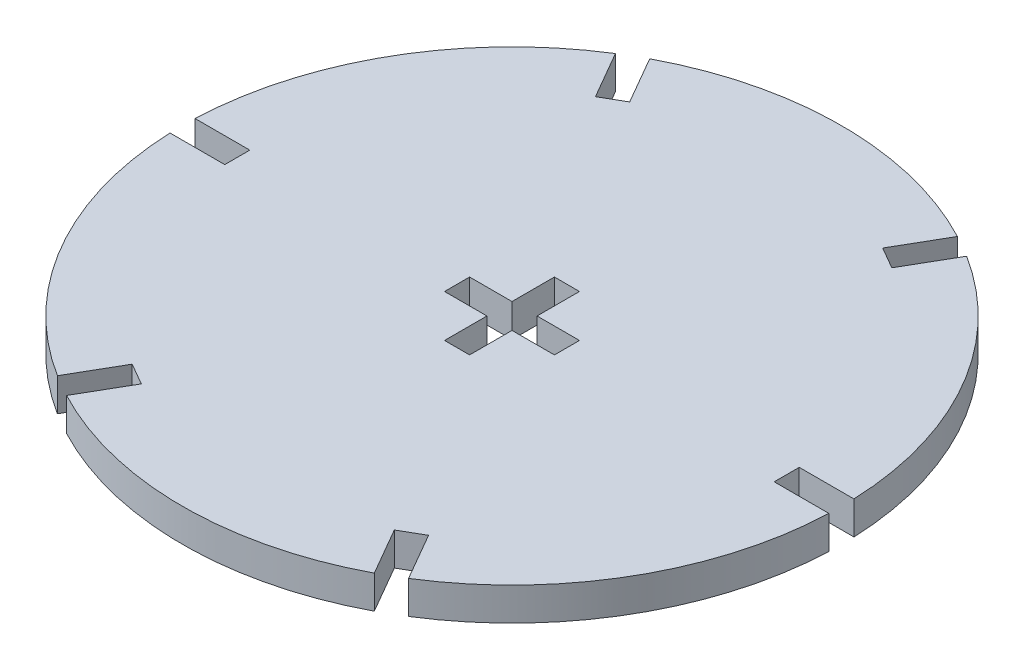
ISO-10303-21;
HEADER;
FILE_DESCRIPTION(('STEP AP214'),'2;1');
FILE_NAME('part.step','',(''),(''),'','','');
FILE_SCHEMA(('AUTOMOTIVE_DESIGN { 1 0 10303 214 1 1 1 1 }'));
ENDSEC;
DATA;
#1=APPLICATION_CONTEXT('core data for automotive mechanical design processes');
#2=APPLICATION_PROTOCOL_DEFINITION('international standard','automotive_design',2000,#1);
#3=PRODUCT_CONTEXT('',#1,'mechanical');
#4=PRODUCT('Part','Part','',(#3));
#5=PRODUCT_RELATED_PRODUCT_CATEGORY('part','',(#4));
#6=PRODUCT_DEFINITION_FORMATION('','',#4);
#7=PRODUCT_DEFINITION_CONTEXT('part definition',#1,'design');
#8=PRODUCT_DEFINITION('design','',#6,#7);
#9=PRODUCT_DEFINITION_SHAPE('','',#8);
#10=(LENGTH_UNIT() NAMED_UNIT(*) SI_UNIT(.MILLI.,.METRE.));
#11=(NAMED_UNIT(*) PLANE_ANGLE_UNIT() SI_UNIT($,.RADIAN.));
#12=(NAMED_UNIT(*) SI_UNIT($,.STERADIAN.) SOLID_ANGLE_UNIT());
#13=UNCERTAINTY_MEASURE_WITH_UNIT(LENGTH_MEASURE(1.E-05),#10,'distance_accuracy_value','');
#14=(GEOMETRIC_REPRESENTATION_CONTEXT(3) GLOBAL_UNCERTAINTY_ASSIGNED_CONTEXT((#13)) GLOBAL_UNIT_ASSIGNED_CONTEXT((#10,
#11,#12)) REPRESENTATION_CONTEXT('',''));
#15=CARTESIAN_POINT('',(0.,0.,0.));
#16=DIRECTION('',(0.,0.,1.));
#17=DIRECTION('',(1.,0.,0.));
#18=AXIS2_PLACEMENT_3D('',#15,#16,#17);
#19=CARTESIAN_POINT('',(0.987268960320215,3.,-0.570000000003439));
#20=DIRECTION('',(-0.866025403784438,0.,0.500000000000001));
#21=DIRECTION('',(0.500000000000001,0.,0.866025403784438));
#22=AXIS2_PLACEMENT_3D('',#19,#20,#21);
#23=PLANE('',#22);
#24=DIRECTION('',(-0.5,0.,-0.866025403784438));
#25=VECTOR('',#24,1.);
#26=CARTESIAN_POINT('',(0.987268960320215,0.,-0.570000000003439));
#27=LINE('',#26,#25);
#28=CARTESIAN_POINT('',(15.9764350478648,0.,25.3919972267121));
#29=VERTEX_POINT('',#28);
#30=CARTESIAN_POINT('',(13.4872689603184,0.,21.0806350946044));
#31=VERTEX_POINT('',#30);
#32=EDGE_CURVE('E392',#29,#31,#27,.T.);
#33=ORIENTED_EDGE('',*,*,#32,.F.);
#34=DIRECTION('',(0.,-1.,0.));
#35=VECTOR('',#34,1.);
#36=CARTESIAN_POINT('',(15.9764350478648,3.,25.3919972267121));
#37=LINE('',#36,#35);
#38=CARTESIAN_POINT('',(15.9764350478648,3.,25.3919972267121));
#39=VERTEX_POINT('',#38);
#40=EDGE_CURVE('E615',#39,#29,#37,.T.);
#41=ORIENTED_EDGE('',*,*,#40,.F.);
#42=DIRECTION('',(-0.5,0.,-0.866025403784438));
#43=VECTOR('',#42,1.);
#44=CARTESIAN_POINT('',(0.987268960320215,3.,-0.570000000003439));
#45=LINE('',#44,#43);
#46=CARTESIAN_POINT('',(13.4872689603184,3.,21.0806350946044));
#47=VERTEX_POINT('',#46);
#48=EDGE_CURVE('E393',#39,#47,#45,.T.);
#49=ORIENTED_EDGE('',*,*,#48,.T.);
#50=DIRECTION('',(0.,-1.,0.));
#51=VECTOR('',#50,1.);
#52=CARTESIAN_POINT('',(13.4872689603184,3.,21.0806350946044));
#53=LINE('',#52,#51);
#54=EDGE_CURVE('E462',#47,#31,#53,.T.);
#55=ORIENTED_EDGE('',*,*,#54,.T.);
#56=EDGE_LOOP('',(#33,#41,#49,#55));
#57=FACE_BOUND('',#56,.T.);
#58=ADVANCED_FACE('F69',(#57),#23,.T.);
#59=CARTESIAN_POINT('',(0.,3.,0.));
#60=DIRECTION('',(0.,-1.,0.));
#61=DIRECTION('',(0.,0.,-1.));
#62=AXIS2_PLACEMENT_3D('',#59,#60,#61);
#63=CYLINDRICAL_SURFACE('',#62,30.);
#64=CARTESIAN_POINT('',(0.,0.,0.));
#65=DIRECTION('',(0.,1.,0.));
#66=DIRECTION('',(0.,0.,1.));
#67=AXIS2_PLACEMENT_3D('',#64,#65,#66);
#68=CIRCLE('',#67,30.);
#69=CARTESIAN_POINT('',(29.9783321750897,0.,1.13999999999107));
#70=VERTEX_POINT('',#69);
#71=EDGE_CURVE('E466',#29,#70,#68,.T.);
#72=ORIENTED_EDGE('',*,*,#71,.T.);
#73=DIRECTION('',(0.,-1.,0.));
#74=VECTOR('',#73,1.);
#75=CARTESIAN_POINT('',(29.9783321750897,3.,1.13999999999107));
#76=LINE('',#75,#74);
#77=CARTESIAN_POINT('',(29.9783321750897,3.,1.13999999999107));
#78=VERTEX_POINT('',#77);
#79=EDGE_CURVE('E611',#78,#70,#76,.T.);
#80=ORIENTED_EDGE('',*,*,#79,.F.);
#81=CARTESIAN_POINT('',(0.,3.,0.));
#82=DIRECTION('',(0.,1.,0.));
#83=DIRECTION('',(0.,0.,1.));
#84=AXIS2_PLACEMENT_3D('',#81,#82,#83);
#85=CIRCLE('',#84,30.);
#86=EDGE_CURVE('E397',#39,#78,#85,.T.);
#87=ORIENTED_EDGE('',*,*,#86,.F.);
#88=ORIENTED_EDGE('',*,*,#40,.T.);
#89=EDGE_LOOP('',(#72,#80,#87,#88));
#90=FACE_BOUND('',#89,.T.);
#91=ADVANCED_FACE('F703',(#90),#63,.T.);
#92=CARTESIAN_POINT('',(0.,3.,1.13999999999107));
#93=DIRECTION('',(0.,0.,1.));
#94=DIRECTION('',(1.,0.,0.));
#95=AXIS2_PLACEMENT_3D('',#92,#93,#94);
#96=PLANE('',#95);
#97=DIRECTION('',(-1.,0.,0.));
#98=VECTOR('',#97,1.);
#99=CARTESIAN_POINT('',(0.,0.,1.13999999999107));
#100=LINE('',#99,#98);
#101=CARTESIAN_POINT('',(25.0000000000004,0.,1.13999999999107));
#102=VERTEX_POINT('',#101);
#103=EDGE_CURVE('E469',#70,#102,#100,.T.);
#104=ORIENTED_EDGE('',*,*,#103,.T.);
#105=DIRECTION('',(0.,-1.,0.));
#106=VECTOR('',#105,1.);
#107=CARTESIAN_POINT('',(25.0000000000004,3.,1.13999999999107));
#108=LINE('',#107,#106);
#109=CARTESIAN_POINT('',(25.0000000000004,3.,1.13999999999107));
#110=VERTEX_POINT('',#109);
#111=EDGE_CURVE('E607',#110,#102,#108,.T.);
#112=ORIENTED_EDGE('',*,*,#111,.F.);
#113=DIRECTION('',(-1.,0.,0.));
#114=VECTOR('',#113,1.);
#115=CARTESIAN_POINT('',(0.,3.,1.13999999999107));
#116=LINE('',#115,#114);
#117=EDGE_CURVE('E401',#78,#110,#116,.T.);
#118=ORIENTED_EDGE('',*,*,#117,.F.);
#119=ORIENTED_EDGE('',*,*,#79,.T.);
#120=EDGE_LOOP('',(#104,#112,#118,#119));
#121=FACE_BOUND('',#120,.T.);
#122=ADVANCED_FACE('F708',(#121),#96,.F.);
#123=CARTESIAN_POINT('',(25.0000000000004,3.,0.));
#124=DIRECTION('',(-1.,0.,0.));
#125=DIRECTION('',(0.,0.,1.));
#126=AXIS2_PLACEMENT_3D('',#123,#124,#125);
#127=PLANE('',#126);
#128=DIRECTION('',(0.,0.,-1.));
#129=VECTOR('',#128,1.);
#130=CARTESIAN_POINT('',(25.0000000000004,0.,0.));
#131=LINE('',#130,#129);
#132=CARTESIAN_POINT('',(25.0000000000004,0.,-1.14000000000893));
#133=VERTEX_POINT('',#132);
#134=EDGE_CURVE('E474',#102,#133,#131,.T.);
#135=ORIENTED_EDGE('',*,*,#134,.T.);
#136=DIRECTION('',(0.,-1.,0.));
#137=VECTOR('',#136,1.);
#138=CARTESIAN_POINT('',(25.0000000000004,3.,-1.14000000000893));
#139=LINE('',#138,#137);
#140=CARTESIAN_POINT('',(25.0000000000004,3.,-1.14000000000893));
#141=VERTEX_POINT('',#140);
#142=EDGE_CURVE('E604',#141,#133,#139,.T.);
#143=ORIENTED_EDGE('',*,*,#142,.F.);
#144=DIRECTION('',(0.,0.,-1.));
#145=VECTOR('',#144,1.);
#146=CARTESIAN_POINT('',(25.0000000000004,3.,0.));
#147=LINE('',#146,#145);
#148=EDGE_CURVE('E406',#110,#141,#147,.T.);
#149=ORIENTED_EDGE('',*,*,#148,.F.);
#150=ORIENTED_EDGE('',*,*,#111,.T.);
#151=EDGE_LOOP('',(#135,#143,#149,#150));
#152=FACE_BOUND('',#151,.T.);
#153=ADVANCED_FACE('F713',(#152),#127,.F.);
#154=CARTESIAN_POINT('',(0.,3.,-1.14000000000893));
#155=DIRECTION('',(0.,0.,1.));
#156=DIRECTION('',(1.,0.,0.));
#157=AXIS2_PLACEMENT_3D('',#154,#155,#156);
#158=PLANE('',#157);
#159=DIRECTION('',(-1.,0.,0.));
#160=VECTOR('',#159,1.);
#161=CARTESIAN_POINT('',(0.,0.,-1.14000000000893));
#162=LINE('',#161,#160);
#163=CARTESIAN_POINT('',(29.9783321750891,0.,-1.14000000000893));
#164=VERTEX_POINT('',#163);
#165=EDGE_CURVE('E478',#164,#133,#162,.T.);
#166=ORIENTED_EDGE('',*,*,#165,.F.);
#167=DIRECTION('',(0.,-1.,0.));
#168=VECTOR('',#167,1.);
#169=CARTESIAN_POINT('',(29.9783321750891,3.,-1.14000000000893));
#170=LINE('',#169,#168);
#171=CARTESIAN_POINT('',(29.9783321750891,3.,-1.14000000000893));
#172=VERTEX_POINT('',#171);
#173=EDGE_CURVE('E601',#172,#164,#170,.T.);
#174=ORIENTED_EDGE('',*,*,#173,.F.);
#175=DIRECTION('',(-1.,0.,0.));
#176=VECTOR('',#175,1.);
#177=CARTESIAN_POINT('',(0.,3.,-1.14000000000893));
#178=LINE('',#177,#176);
#179=EDGE_CURVE('E409',#172,#141,#178,.T.);
#180=ORIENTED_EDGE('',*,*,#179,.T.);
#181=ORIENTED_EDGE('',*,*,#142,.T.);
#182=EDGE_LOOP('',(#166,#174,#180,#181));
#183=FACE_BOUND('',#182,.T.);
#184=ADVANCED_FACE('F717',(#183),#158,.T.);
#185=CARTESIAN_POINT('',(15.9764350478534,0.,-25.3919972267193));
#186=VERTEX_POINT('',#185);
#187=EDGE_CURVE('E471',#164,#186,#68,.T.);
#188=ORIENTED_EDGE('',*,*,#187,.T.);
#189=DIRECTION('',(0.,-1.,0.));
#190=VECTOR('',#189,1.);
#191=CARTESIAN_POINT('',(15.9764350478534,3.,-25.3919972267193));
#192=LINE('',#191,#190);
#193=CARTESIAN_POINT('',(15.9764350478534,3.,-25.3919972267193));
#194=VERTEX_POINT('',#193);
#195=EDGE_CURVE('E597',#194,#186,#192,.T.);
#196=ORIENTED_EDGE('',*,*,#195,.F.);
#197=EDGE_CURVE('E403',#172,#194,#85,.T.);
#198=ORIENTED_EDGE('',*,*,#197,.F.);
#199=ORIENTED_EDGE('',*,*,#173,.T.);
#200=EDGE_LOOP('',(#188,#196,#198,#199));
#201=FACE_BOUND('',#200,.T.);
#202=ADVANCED_FACE('F722',(#201),#63,.T.);
#203=CARTESIAN_POINT('',(0.987268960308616,3.,0.569999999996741));
#204=DIRECTION('',(0.866025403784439,0.,0.5));
#205=DIRECTION('',(0.5,0.,-0.866025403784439));
#206=AXIS2_PLACEMENT_3D('',#203,#204,#205);
#207=PLANE('',#206);
#208=DIRECTION('',(-0.5,0.,0.866025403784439));
#209=VECTOR('',#208,1.);
#210=CARTESIAN_POINT('',(0.987268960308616,0.,0.569999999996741));
#211=LINE('',#210,#209);
#212=CARTESIAN_POINT('',(13.4872689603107,0.,-21.0806350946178));
#213=VERTEX_POINT('',#212);
#214=EDGE_CURVE('E482',#186,#213,#211,.T.);
#215=ORIENTED_EDGE('',*,*,#214,.T.);
#216=DIRECTION('',(0.,-1.,0.));
#217=VECTOR('',#216,1.);
#218=CARTESIAN_POINT('',(13.4872689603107,3.,-21.0806350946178));
#219=LINE('',#218,#217);
#220=CARTESIAN_POINT('',(13.4872689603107,3.,-21.0806350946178));
#221=VERTEX_POINT('',#220);
#222=EDGE_CURVE('E593',#221,#213,#219,.T.);
#223=ORIENTED_EDGE('',*,*,#222,.F.);
#224=DIRECTION('',(-0.5,0.,0.866025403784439));
#225=VECTOR('',#224,1.);
#226=CARTESIAN_POINT('',(0.987268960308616,3.,0.569999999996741));
#227=LINE('',#226,#225);
#228=EDGE_CURVE('E413',#194,#221,#227,.T.);
#229=ORIENTED_EDGE('',*,*,#228,.F.);
#230=ORIENTED_EDGE('',*,*,#195,.T.);
#231=EDGE_LOOP('',(#215,#223,#229,#230));
#232=FACE_BOUND('',#231,.T.);
#233=ADVANCED_FACE('F729',(#232),#207,.F.);
#234=CARTESIAN_POINT('',(12.5000000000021,3.,-21.6506350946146));
#235=DIRECTION('',(-0.5,0.,0.866025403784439));
#236=DIRECTION('',(0.866025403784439,0.,0.5));
#237=AXIS2_PLACEMENT_3D('',#234,#235,#236);
#238=PLANE('',#237);
#239=DIRECTION('',(-0.866025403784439,0.,-0.5));
#240=VECTOR('',#239,1.);
#241=CARTESIAN_POINT('',(12.5000000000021,0.,-21.6506350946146));
#242=LINE('',#241,#240);
#243=CARTESIAN_POINT('',(11.5127310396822,0.,-22.2206350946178));
#244=VERTEX_POINT('',#243);
#245=EDGE_CURVE('E485',#213,#244,#242,.T.);
#246=ORIENTED_EDGE('',*,*,#245,.T.);
#247=DIRECTION('',(0.,-1.,0.));
#248=VECTOR('',#247,1.);
#249=CARTESIAN_POINT('',(11.5127310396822,3.,-22.2206350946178));
#250=LINE('',#249,#248);
#251=CARTESIAN_POINT('',(11.5127310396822,3.,-22.2206350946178));
#252=VERTEX_POINT('',#251);
#253=EDGE_CURVE('E590',#252,#244,#250,.T.);
#254=ORIENTED_EDGE('',*,*,#253,.F.);
#255=DIRECTION('',(-0.866025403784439,0.,-0.5));
#256=VECTOR('',#255,1.);
#257=CARTESIAN_POINT('',(12.5000000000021,3.,-21.6506350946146));
#258=LINE('',#257,#256);
#259=EDGE_CURVE('E416',#221,#252,#258,.T.);
#260=ORIENTED_EDGE('',*,*,#259,.F.);
#261=ORIENTED_EDGE('',*,*,#222,.T.);
#262=EDGE_LOOP('',(#246,#254,#260,#261));
#263=FACE_BOUND('',#262,.T.);
#264=ADVANCED_FACE('F733',(#263),#238,.F.);
#265=CARTESIAN_POINT('',(-0.987268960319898,3.,-0.570000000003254));
#266=DIRECTION('',(0.866025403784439,0.,0.499999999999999));
#267=DIRECTION('',(0.499999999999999,0.,-0.866025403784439));
#268=AXIS2_PLACEMENT_3D('',#265,#266,#267);
#269=PLANE('',#268);
#270=DIRECTION('',(-0.5,0.,0.866025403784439));
#271=VECTOR('',#270,1.);
#272=CARTESIAN_POINT('',(-0.987268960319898,0.,-0.570000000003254));
#273=LINE('',#272,#271);
#274=CARTESIAN_POINT('',(14.0018971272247,0.,-26.5319972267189));
#275=VERTEX_POINT('',#274);
#276=EDGE_CURVE('E489',#275,#244,#273,.T.);
#277=ORIENTED_EDGE('',*,*,#276,.F.);
#278=DIRECTION('',(0.,-1.,0.));
#279=VECTOR('',#278,1.);
#280=CARTESIAN_POINT('',(14.0018971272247,3.,-26.5319972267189));
#281=LINE('',#280,#279);
#282=CARTESIAN_POINT('',(14.0018971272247,3.,-26.5319972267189));
#283=VERTEX_POINT('',#282);
#284=EDGE_CURVE('E587',#283,#275,#281,.T.);
#285=ORIENTED_EDGE('',*,*,#284,.F.);
#286=DIRECTION('',(-0.5,0.,0.866025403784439));
#287=VECTOR('',#286,1.);
#288=CARTESIAN_POINT('',(-0.987268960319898,3.,-0.570000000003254));
#289=LINE('',#288,#287);
#290=EDGE_CURVE('E419',#283,#252,#289,.T.);
#291=ORIENTED_EDGE('',*,*,#290,.T.);
#292=ORIENTED_EDGE('',*,*,#253,.T.);
#293=EDGE_LOOP('',(#277,#285,#291,#292));
#294=FACE_BOUND('',#293,.T.);
#295=ADVANCED_FACE('F736',(#294),#269,.T.);
#296=CARTESIAN_POINT('',(-14.0018971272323,0.,-26.5319972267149));
#297=VERTEX_POINT('',#296);
#298=EDGE_CURVE('E493',#275,#297,#68,.T.);
#299=ORIENTED_EDGE('',*,*,#298,.T.);
#300=DIRECTION('',(0.,-1.,0.));
#301=VECTOR('',#300,1.);
#302=CARTESIAN_POINT('',(-14.0018971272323,3.,-26.5319972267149));
#303=LINE('',#302,#301);
#304=CARTESIAN_POINT('',(-14.0018971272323,3.,-26.5319972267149));
#305=VERTEX_POINT('',#304);
#306=EDGE_CURVE('E583',#305,#297,#303,.T.);
#307=ORIENTED_EDGE('',*,*,#306,.F.);
#308=EDGE_CURVE('E423',#283,#305,#85,.T.);
#309=ORIENTED_EDGE('',*,*,#308,.F.);
#310=ORIENTED_EDGE('',*,*,#284,.T.);
#311=EDGE_LOOP('',(#299,#307,#309,#310));
#312=FACE_BOUND('',#311,.T.);
#313=ADVANCED_FACE('F742',(#312),#63,.T.);
#314=CARTESIAN_POINT('',(0.987268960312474,3.,-0.569999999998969));
#315=DIRECTION('',(0.866025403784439,0.,-0.5));
#316=DIRECTION('',(-0.5,0.,-0.866025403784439));
#317=AXIS2_PLACEMENT_3D('',#314,#315,#316);
#318=PLANE('',#317);
#319=DIRECTION('',(0.5,0.,0.866025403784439));
#320=VECTOR('',#319,1.);
#321=CARTESIAN_POINT('',(0.987268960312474,0.,-0.569999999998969));
#322=LINE('',#321,#320);
#323=CARTESIAN_POINT('',(-11.5127310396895,0.,-22.2206350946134));
#324=VERTEX_POINT('',#323);
#325=EDGE_CURVE('E494',#297,#324,#322,.T.);
#326=ORIENTED_EDGE('',*,*,#325,.T.);
#327=DIRECTION('',(0.,-1.,0.));
#328=VECTOR('',#327,1.);
#329=CARTESIAN_POINT('',(-11.5127310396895,3.,-22.2206350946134));
#330=LINE('',#329,#328);
#331=CARTESIAN_POINT('',(-11.5127310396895,3.,-22.2206350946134));
#332=VERTEX_POINT('',#331);
#333=EDGE_CURVE('E579',#332,#324,#330,.T.);
#334=ORIENTED_EDGE('',*,*,#333,.F.);
#335=DIRECTION('',(0.5,0.,0.866025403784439));
#336=VECTOR('',#335,1.);
#337=CARTESIAN_POINT('',(0.987268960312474,3.,-0.569999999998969));
#338=LINE('',#337,#336);
#339=EDGE_CURVE('E424',#305,#332,#338,.T.);
#340=ORIENTED_EDGE('',*,*,#339,.F.);
#341=ORIENTED_EDGE('',*,*,#306,.T.);
#342=EDGE_LOOP('',(#326,#334,#340,#341));
#343=FACE_BOUND('',#342,.T.);
#344=ADVANCED_FACE('F746',(#343),#318,.F.);
#345=CARTESIAN_POINT('',(-12.500000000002,3.,-21.6506350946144));
#346=DIRECTION('',(0.5,0.,0.866025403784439));
#347=DIRECTION('',(0.866025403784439,0.,-0.5));
#348=AXIS2_PLACEMENT_3D('',#345,#346,#347);
#349=PLANE('',#348);
#350=DIRECTION('',(-0.866025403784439,0.,0.5));
#351=VECTOR('',#350,1.);
#352=CARTESIAN_POINT('',(-12.500000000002,0.,-21.6506350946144));
#353=LINE('',#352,#351);
#354=CARTESIAN_POINT('',(-13.487268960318,0.,-21.0806350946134));
#355=VERTEX_POINT('',#354);
#356=EDGE_CURVE('E497',#324,#355,#353,.T.);
#357=ORIENTED_EDGE('',*,*,#356,.T.);
#358=DIRECTION('',(0.,-1.,0.));
#359=VECTOR('',#358,1.);
#360=CARTESIAN_POINT('',(-13.487268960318,3.,-21.0806350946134));
#361=LINE('',#360,#359);
#362=CARTESIAN_POINT('',(-13.487268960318,3.,-21.0806350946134));
#363=VERTEX_POINT('',#362);
#364=EDGE_CURVE('E576',#363,#355,#361,.T.);
#365=ORIENTED_EDGE('',*,*,#364,.F.);
#366=DIRECTION('',(-0.866025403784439,0.,0.5));
#367=VECTOR('',#366,1.);
#368=CARTESIAN_POINT('',(-12.500000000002,3.,-21.6506350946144));
#369=LINE('',#368,#367);
#370=EDGE_CURVE('E427',#332,#363,#369,.T.);
#371=ORIENTED_EDGE('',*,*,#370,.F.);
#372=ORIENTED_EDGE('',*,*,#333,.T.);
#373=EDGE_LOOP('',(#357,#365,#371,#372));
#374=FACE_BOUND('',#373,.T.);
#375=ADVANCED_FACE('F751',(#374),#349,.F.);
#376=CARTESIAN_POINT('',(-0.987268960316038,3.,0.570000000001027));
#377=DIRECTION('',(0.866025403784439,0.,-0.5));
#378=DIRECTION('',(-0.5,0.,-0.866025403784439));
#379=AXIS2_PLACEMENT_3D('',#376,#377,#378);
#380=PLANE('',#379);
#381=DIRECTION('',(0.5,0.,0.866025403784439));
#382=VECTOR('',#381,1.);
#383=CARTESIAN_POINT('',(-0.987268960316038,0.,0.570000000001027));
#384=LINE('',#383,#382);
#385=CARTESIAN_POINT('',(-15.9764350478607,0.,-25.3919972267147));
#386=VERTEX_POINT('',#385);
#387=EDGE_CURVE('E501',#386,#355,#384,.T.);
#388=ORIENTED_EDGE('',*,*,#387,.F.);
#389=DIRECTION('',(0.,-1.,0.));
#390=VECTOR('',#389,1.);
#391=CARTESIAN_POINT('',(-15.9764350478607,3.,-25.3919972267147));
#392=LINE('',#391,#390);
#393=CARTESIAN_POINT('',(-15.9764350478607,3.,-25.3919972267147));
#394=VERTEX_POINT('',#393);
#395=EDGE_CURVE('E573',#394,#386,#392,.T.);
#396=ORIENTED_EDGE('',*,*,#395,.F.);
#397=DIRECTION('',(0.5,0.,0.866025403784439));
#398=VECTOR('',#397,1.);
#399=CARTESIAN_POINT('',(-0.987268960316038,3.,0.570000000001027));
#400=LINE('',#399,#398);
#401=EDGE_CURVE('E430',#394,#363,#400,.T.);
#402=ORIENTED_EDGE('',*,*,#401,.T.);
#403=ORIENTED_EDGE('',*,*,#364,.T.);
#404=EDGE_LOOP('',(#388,#396,#402,#403));
#405=FACE_BOUND('',#404,.T.);
#406=ADVANCED_FACE('F757',(#405),#380,.T.);
#407=CARTESIAN_POINT('',(-29.9783321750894,0.,-1.13999999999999));
#408=VERTEX_POINT('',#407);
#409=EDGE_CURVE('E505',#386,#408,#68,.T.);
#410=ORIENTED_EDGE('',*,*,#409,.T.);
#411=DIRECTION('',(0.,-1.,0.));
#412=VECTOR('',#411,1.);
#413=CARTESIAN_POINT('',(-29.9783321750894,3.,-1.13999999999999));
#414=LINE('',#413,#412);
#415=CARTESIAN_POINT('',(-29.9783321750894,3.,-1.13999999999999));
#416=VERTEX_POINT('',#415);
#417=EDGE_CURVE('E569',#416,#408,#414,.T.);
#418=ORIENTED_EDGE('',*,*,#417,.F.);
#419=EDGE_CURVE('E434',#394,#416,#85,.T.);
#420=ORIENTED_EDGE('',*,*,#419,.F.);
#421=ORIENTED_EDGE('',*,*,#395,.T.);
#422=EDGE_LOOP('',(#410,#418,#420,#421));
#423=FACE_BOUND('',#422,.T.);
#424=ADVANCED_FACE('F760',(#423),#63,.T.);
#425=CARTESIAN_POINT('',(0.,3.,-1.13999999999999));
#426=DIRECTION('',(0.,0.,-1.));
#427=DIRECTION('',(-1.,0.,0.));
#428=AXIS2_PLACEMENT_3D('',#425,#426,#427);
#429=PLANE('',#428);
#430=DIRECTION('',(1.,0.,0.));
#431=VECTOR('',#430,1.);
#432=CARTESIAN_POINT('',(0.,0.,-1.13999999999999));
#433=LINE('',#432,#431);
#434=CARTESIAN_POINT('',(-25.,0.,-1.13999999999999));
#435=VERTEX_POINT('',#434);
#436=EDGE_CURVE('E506',#408,#435,#433,.T.);
#437=ORIENTED_EDGE('',*,*,#436,.T.);
#438=DIRECTION('',(0.,-1.,0.));
#439=VECTOR('',#438,1.);
#440=CARTESIAN_POINT('',(-25.,3.,-1.13999999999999));
#441=LINE('',#440,#439);
#442=CARTESIAN_POINT('',(-25.,3.,-1.13999999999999));
#443=VERTEX_POINT('',#442);
#444=EDGE_CURVE('E565',#443,#435,#441,.T.);
#445=ORIENTED_EDGE('',*,*,#444,.F.);
#446=DIRECTION('',(1.,0.,0.));
#447=VECTOR('',#446,1.);
#448=CARTESIAN_POINT('',(0.,3.,-1.13999999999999));
#449=LINE('',#448,#447);
#450=EDGE_CURVE('E435',#416,#443,#449,.T.);
#451=ORIENTED_EDGE('',*,*,#450,.F.);
#452=ORIENTED_EDGE('',*,*,#417,.T.);
#453=EDGE_LOOP('',(#437,#445,#451,#452));
#454=FACE_BOUND('',#453,.T.);
#455=ADVANCED_FACE('F765',(#454),#429,.F.);
#456=CARTESIAN_POINT('',(-25.,3.,0.));
#457=DIRECTION('',(1.,0.,0.));
#458=DIRECTION('',(0.,0.,-1.));
#459=AXIS2_PLACEMENT_3D('',#456,#457,#458);
#460=PLANE('',#459);
#461=DIRECTION('',(0.,0.,1.));
#462=VECTOR('',#461,1.);
#463=CARTESIAN_POINT('',(-25.,0.,0.));
#464=LINE('',#463,#462);
#465=CARTESIAN_POINT('',(-25.,0.,1.14000000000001));
#466=VERTEX_POINT('',#465);
#467=EDGE_CURVE('E509',#435,#466,#464,.T.);
#468=ORIENTED_EDGE('',*,*,#467,.T.);
#469=DIRECTION('',(0.,-1.,0.));
#470=VECTOR('',#469,1.);
#471=CARTESIAN_POINT('',(-25.,3.,1.14000000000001));
#472=LINE('',#471,#470);
#473=CARTESIAN_POINT('',(-25.,3.,1.14000000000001));
#474=VERTEX_POINT('',#473);
#475=EDGE_CURVE('E562',#474,#466,#472,.T.);
#476=ORIENTED_EDGE('',*,*,#475,.F.);
#477=DIRECTION('',(0.,0.,1.));
#478=VECTOR('',#477,1.);
#479=CARTESIAN_POINT('',(-25.,3.,0.));
#480=LINE('',#479,#478);
#481=EDGE_CURVE('E438',#443,#474,#480,.T.);
#482=ORIENTED_EDGE('',*,*,#481,.F.);
#483=ORIENTED_EDGE('',*,*,#444,.T.);
#484=EDGE_LOOP('',(#468,#476,#482,#483));
#485=FACE_BOUND('',#484,.T.);
#486=ADVANCED_FACE('F770',(#485),#460,.F.);
#487=CARTESIAN_POINT('',(0.,3.,1.14000000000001));
#488=DIRECTION('',(0.,0.,-1.));
#489=DIRECTION('',(-1.,0.,0.));
#490=AXIS2_PLACEMENT_3D('',#487,#488,#489);
#491=PLANE('',#490);
#492=DIRECTION('',(1.,0.,0.));
#493=VECTOR('',#492,1.);
#494=CARTESIAN_POINT('',(0.,0.,1.14000000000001));
#495=LINE('',#494,#493);
#496=CARTESIAN_POINT('',(-29.9783321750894,0.,1.14000000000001));
#497=VERTEX_POINT('',#496);
#498=EDGE_CURVE('E513',#497,#466,#495,.T.);
#499=ORIENTED_EDGE('',*,*,#498,.F.);
#500=DIRECTION('',(0.,-1.,0.));
#501=VECTOR('',#500,1.);
#502=CARTESIAN_POINT('',(-29.9783321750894,3.,1.14000000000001));
#503=LINE('',#502,#501);
#504=CARTESIAN_POINT('',(-29.9783321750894,3.,1.14000000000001));
#505=VERTEX_POINT('',#504);
#506=EDGE_CURVE('E559',#505,#497,#503,.T.);
#507=ORIENTED_EDGE('',*,*,#506,.F.);
#508=DIRECTION('',(1.,0.,0.));
#509=VECTOR('',#508,1.);
#510=CARTESIAN_POINT('',(0.,3.,1.14000000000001));
#511=LINE('',#510,#509);
#512=EDGE_CURVE('E441',#505,#474,#511,.T.);
#513=ORIENTED_EDGE('',*,*,#512,.T.);
#514=ORIENTED_EDGE('',*,*,#475,.T.);
#515=EDGE_LOOP('',(#499,#507,#513,#514));
#516=FACE_BOUND('',#515,.T.);
#517=ADVANCED_FACE('F774',(#516),#491,.T.);
#518=CARTESIAN_POINT('',(-15.9764350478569,0.,25.3919972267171));
#519=VERTEX_POINT('',#518);
#520=EDGE_CURVE('E517',#497,#519,#68,.T.);
#521=ORIENTED_EDGE('',*,*,#520,.T.);
#522=DIRECTION('',(0.,-1.,0.));
#523=VECTOR('',#522,1.);
#524=CARTESIAN_POINT('',(-15.9764350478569,3.,25.3919972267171));
#525=LINE('',#524,#523);
#526=CARTESIAN_POINT('',(-15.9764350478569,3.,25.3919972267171));
#527=VERTEX_POINT('',#526);
#528=EDGE_CURVE('E555',#527,#519,#525,.T.);
#529=ORIENTED_EDGE('',*,*,#528,.F.);
#530=EDGE_CURVE('E445',#505,#527,#85,.T.);
#531=ORIENTED_EDGE('',*,*,#530,.F.);
#532=ORIENTED_EDGE('',*,*,#506,.T.);
#533=EDGE_LOOP('',(#521,#529,#531,#532));
#534=FACE_BOUND('',#533,.T.);
#535=ADVANCED_FACE('F779',(#534),#63,.T.);
#536=CARTESIAN_POINT('',(-0.987268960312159,3.,-0.569999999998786));
#537=DIRECTION('',(-0.866025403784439,0.,-0.499999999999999));
#538=DIRECTION('',(-0.499999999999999,0.,0.866025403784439));
#539=AXIS2_PLACEMENT_3D('',#536,#537,#538);
#540=PLANE('',#539);
#541=DIRECTION('',(0.5,0.,-0.866025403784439));
#542=VECTOR('',#541,1.);
#543=CARTESIAN_POINT('',(-0.987268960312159,0.,-0.569999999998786));
#544=LINE('',#543,#542);
#545=CARTESIAN_POINT('',(-13.4872689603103,0.,21.0806350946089));
#546=VERTEX_POINT('',#545);
#547=EDGE_CURVE('E518',#519,#546,#544,.T.);
#548=ORIENTED_EDGE('',*,*,#547,.T.);
#549=DIRECTION('',(0.,-1.,0.));
#550=VECTOR('',#549,1.);
#551=CARTESIAN_POINT('',(-13.4872689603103,3.,21.0806350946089));
#552=LINE('',#551,#550);
#553=CARTESIAN_POINT('',(-13.4872689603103,3.,21.0806350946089));
#554=VERTEX_POINT('',#553);
#555=EDGE_CURVE('E551',#554,#546,#552,.T.);
#556=ORIENTED_EDGE('',*,*,#555,.F.);
#557=DIRECTION('',(0.5,0.,-0.866025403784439));
#558=VECTOR('',#557,1.);
#559=CARTESIAN_POINT('',(-0.987268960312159,3.,-0.569999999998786));
#560=LINE('',#559,#558);
#561=EDGE_CURVE('E446',#527,#554,#560,.T.);
#562=ORIENTED_EDGE('',*,*,#561,.F.);
#563=ORIENTED_EDGE('',*,*,#528,.T.);
#564=EDGE_LOOP('',(#548,#556,#562,#563));
#565=FACE_BOUND('',#564,.T.);
#566=ADVANCED_FACE('F785',(#565),#540,.F.);
#567=CARTESIAN_POINT('',(-12.4999999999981,3.,21.6506350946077));
#568=DIRECTION('',(0.499999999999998,0.,-0.86602540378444));
#569=DIRECTION('',(-0.86602540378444,0.,-0.499999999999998));
#570=AXIS2_PLACEMENT_3D('',#567,#568,#569);
#571=PLANE('',#570);
#572=DIRECTION('',(0.86602540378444,0.,0.499999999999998));
#573=VECTOR('',#572,1.);
#574=CARTESIAN_POINT('',(-12.4999999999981,0.,21.6506350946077));
#575=LINE('',#574,#573);
#576=CARTESIAN_POINT('',(-11.5127310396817,0.,22.2206350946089));
#577=VERTEX_POINT('',#576);
#578=EDGE_CURVE('E521',#546,#577,#575,.T.);
#579=ORIENTED_EDGE('',*,*,#578,.T.);
#580=DIRECTION('',(0.,-1.,0.));
#581=VECTOR('',#580,1.);
#582=CARTESIAN_POINT('',(-11.5127310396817,3.,22.2206350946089));
#583=LINE('',#582,#581);
#584=CARTESIAN_POINT('',(-11.5127310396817,3.,22.2206350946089));
#585=VERTEX_POINT('',#584);
#586=EDGE_CURVE('E548',#585,#577,#583,.T.);
#587=ORIENTED_EDGE('',*,*,#586,.F.);
#588=DIRECTION('',(0.86602540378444,0.,0.499999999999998));
#589=VECTOR('',#588,1.);
#590=CARTESIAN_POINT('',(-12.4999999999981,3.,21.6506350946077));
#591=LINE('',#590,#589);
#592=EDGE_CURVE('E449',#554,#585,#591,.T.);
#593=ORIENTED_EDGE('',*,*,#592,.F.);
#594=ORIENTED_EDGE('',*,*,#555,.T.);
#595=EDGE_LOOP('',(#579,#587,#593,#594));
#596=FACE_BOUND('',#595,.T.);
#597=ADVANCED_FACE('F789',(#596),#571,.F.);
#598=CARTESIAN_POINT('',(0.987268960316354,3.,0.570000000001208));
#599=DIRECTION('',(-0.866025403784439,0.,-0.499999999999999));
#600=DIRECTION('',(-0.499999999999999,0.,0.866025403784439));
#601=AXIS2_PLACEMENT_3D('',#598,#599,#600);
#602=PLANE('',#601);
#603=DIRECTION('',(0.499999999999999,0.,-0.866025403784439));
#604=VECTOR('',#603,1.);
#605=CARTESIAN_POINT('',(0.987268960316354,0.,0.570000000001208));
#606=LINE('',#605,#604);
#607=CARTESIAN_POINT('',(-14.0018971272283,0.,26.531997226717));
#608=VERTEX_POINT('',#607);
#609=EDGE_CURVE('E525',#608,#577,#606,.T.);
#610=ORIENTED_EDGE('',*,*,#609,.F.);
#611=DIRECTION('',(0.,-1.,0.));
#612=VECTOR('',#611,1.);
#613=CARTESIAN_POINT('',(-14.0018971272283,3.,26.531997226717));
#614=LINE('',#613,#612);
#615=CARTESIAN_POINT('',(-14.0018971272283,3.,26.531997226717));
#616=VERTEX_POINT('',#615);
#617=EDGE_CURVE('E545',#616,#608,#614,.T.);
#618=ORIENTED_EDGE('',*,*,#617,.F.);
#619=DIRECTION('',(0.499999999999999,0.,-0.866025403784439));
#620=VECTOR('',#619,1.);
#621=CARTESIAN_POINT('',(0.987268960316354,3.,0.570000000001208));
#622=LINE('',#621,#620);
#623=EDGE_CURVE('E452',#616,#585,#622,.T.);
#624=ORIENTED_EDGE('',*,*,#623,.T.);
#625=ORIENTED_EDGE('',*,*,#586,.T.);
#626=EDGE_LOOP('',(#610,#618,#624,#625));
#627=FACE_BOUND('',#626,.T.);
#628=ADVANCED_FACE('F792',(#627),#602,.T.);
#629=CARTESIAN_POINT('',(14.0018971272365,0.,26.5319972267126));
#630=VERTEX_POINT('',#629);
#631=EDGE_CURVE('E470',#608,#630,#68,.T.);
#632=ORIENTED_EDGE('',*,*,#631,.T.);
#633=DIRECTION('',(0.,-1.,0.));
#634=VECTOR('',#633,1.);
#635=CARTESIAN_POINT('',(14.0018971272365,3.,26.5319972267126));
#636=LINE('',#635,#634);
#637=CARTESIAN_POINT('',(14.0018971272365,3.,26.5319972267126));
#638=VERTEX_POINT('',#637);
#639=EDGE_CURVE('E541',#638,#630,#636,.T.);
#640=ORIENTED_EDGE('',*,*,#639,.F.);
#641=EDGE_CURVE('E402',#616,#638,#85,.T.);
#642=ORIENTED_EDGE('',*,*,#641,.F.);
#643=ORIENTED_EDGE('',*,*,#617,.T.);
#644=EDGE_LOOP('',(#632,#640,#642,#643));
#645=FACE_BOUND('',#644,.T.);
#646=ADVANCED_FACE('F687',(#645),#63,.T.);
#647=CARTESIAN_POINT('',(-0.987268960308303,3.,0.569999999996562));
#648=DIRECTION('',(-0.866025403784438,0.,0.500000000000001));
#649=DIRECTION('',(0.500000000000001,0.,0.866025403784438));
#650=AXIS2_PLACEMENT_3D('',#647,#648,#649);
#651=PLANE('',#650);
#652=DIRECTION('',(-0.5,0.,-0.866025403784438));
#653=VECTOR('',#652,1.);
#654=CARTESIAN_POINT('',(-0.987268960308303,0.,0.569999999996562));
#655=LINE('',#654,#653);
#656=CARTESIAN_POINT('',(11.5127310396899,0.,22.2206350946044));
#657=VERTEX_POINT('',#656);
#658=EDGE_CURVE('E529',#630,#657,#655,.T.);
#659=ORIENTED_EDGE('',*,*,#658,.T.);
#660=DIRECTION('',(0.,-1.,0.));
#661=VECTOR('',#660,1.);
#662=CARTESIAN_POINT('',(11.5127310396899,3.,22.2206350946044));
#663=LINE('',#662,#661);
#664=CARTESIAN_POINT('',(11.5127310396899,3.,22.2206350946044));
#665=VERTEX_POINT('',#664);
#666=EDGE_CURVE('E537',#665,#657,#663,.T.);
#667=ORIENTED_EDGE('',*,*,#666,.F.);
#668=DIRECTION('',(-0.5,0.,-0.866025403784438));
#669=VECTOR('',#668,1.);
#670=CARTESIAN_POINT('',(-0.987268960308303,3.,0.569999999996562));
#671=LINE('',#670,#669);
#672=EDGE_CURVE('E456',#638,#665,#671,.T.);
#673=ORIENTED_EDGE('',*,*,#672,.F.);
#674=ORIENTED_EDGE('',*,*,#639,.T.);
#675=EDGE_LOOP('',(#659,#667,#673,#674));
#676=FACE_BOUND('',#675,.T.);
#677=ADVANCED_FACE('F691',(#676),#651,.F.);
#678=CARTESIAN_POINT('',(12.4999999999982,3.,21.6506350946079));
#679=DIRECTION('',(-0.500000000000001,0.,-0.866025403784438));
#680=DIRECTION('',(-0.866025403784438,0.,0.500000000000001));
#681=AXIS2_PLACEMENT_3D('',#678,#679,#680);
#682=PLANE('',#681);
#683=DIRECTION('',(0.866025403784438,0.,-0.500000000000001));
#684=VECTOR('',#683,1.);
#685=CARTESIAN_POINT('',(12.4999999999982,0.,21.6506350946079));
#686=LINE('',#685,#684);
#687=EDGE_CURVE('E398',#657,#31,#686,.T.);
#688=ORIENTED_EDGE('',*,*,#687,.T.);
#689=ORIENTED_EDGE('',*,*,#54,.F.);
#690=DIRECTION('',(0.866025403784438,0.,-0.500000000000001));
#691=VECTOR('',#690,1.);
#692=CARTESIAN_POINT('',(12.4999999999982,3.,21.6506350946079));
#693=LINE('',#692,#691);
#694=EDGE_CURVE('E459',#665,#47,#693,.T.);
#695=ORIENTED_EDGE('',*,*,#694,.F.);
#696=ORIENTED_EDGE('',*,*,#666,.T.);
#697=EDGE_LOOP('',(#688,#689,#695,#696));
#698=FACE_BOUND('',#697,.T.);
#699=ADVANCED_FACE('F696',(#698),#682,.F.);
#700=CARTESIAN_POINT('',(0.,3.,0.));
#701=DIRECTION('',(0.,1.,0.));
#702=DIRECTION('',(0.,0.,1.));
#703=AXIS2_PLACEMENT_3D('',#700,#701,#702);
#704=PLANE('',#703);
#705=DIRECTION('',(0.,0.,-1.));
#706=VECTOR('',#705,1.);
#707=CARTESIAN_POINT('',(5.,3.,1.14));
#708=LINE('',#707,#706);
#709=CARTESIAN_POINT('',(5.,3.,1.14));
#710=VERTEX_POINT('',#709);
#711=CARTESIAN_POINT('',(5.,3.,-1.14));
#712=VERTEX_POINT('',#711);
#713=EDGE_CURVE('E324',#710,#712,#708,.T.);
#714=ORIENTED_EDGE('',*,*,#713,.F.);
#715=DIRECTION('',(1.,0.,0.));
#716=VECTOR('',#715,1.);
#717=CARTESIAN_POINT('',(-5.,3.,1.14));
#718=LINE('',#717,#716);
#719=CARTESIAN_POINT('',(1.14,3.,1.14));
#720=VERTEX_POINT('',#719);
#721=EDGE_CURVE('E345',#720,#710,#718,.T.);
#722=ORIENTED_EDGE('',*,*,#721,.F.);
#723=DIRECTION('',(0.,0.,1.));
#724=VECTOR('',#723,1.);
#725=CARTESIAN_POINT('',(1.14,3.,-5.));
#726=LINE('',#725,#724);
#727=CARTESIAN_POINT('',(1.14,3.,5.));
#728=VERTEX_POINT('',#727);
#729=EDGE_CURVE('E358',#720,#728,#726,.T.);
#730=ORIENTED_EDGE('',*,*,#729,.T.);
#731=DIRECTION('',(1.,0.,0.));
#732=VECTOR('',#731,1.);
#733=CARTESIAN_POINT('',(-1.14,3.,5.));
#734=LINE('',#733,#732);
#735=CARTESIAN_POINT('',(-1.14,3.,5.));
#736=VERTEX_POINT('',#735);
#737=EDGE_CURVE('E363',#736,#728,#734,.T.);
#738=ORIENTED_EDGE('',*,*,#737,.F.);
#739=DIRECTION('',(0.,0.,1.));
#740=VECTOR('',#739,1.);
#741=CARTESIAN_POINT('',(-1.14,3.,-5.));
#742=LINE('',#741,#740);
#743=CARTESIAN_POINT('',(-1.14,3.,1.14));
#744=VERTEX_POINT('',#743);
#745=EDGE_CURVE('E367',#744,#736,#742,.T.);
#746=ORIENTED_EDGE('',*,*,#745,.F.);
#747=CARTESIAN_POINT('',(-5.,3.,1.14));
#748=VERTEX_POINT('',#747);
#749=EDGE_CURVE('E332',#748,#744,#718,.T.);
#750=ORIENTED_EDGE('',*,*,#749,.F.);
#751=DIRECTION('',(0.,0.,-1.));
#752=VECTOR('',#751,1.);
#753=CARTESIAN_POINT('',(-5.,3.,1.14));
#754=LINE('',#753,#752);
#755=CARTESIAN_POINT('',(-5.,3.,-1.14));
#756=VERTEX_POINT('',#755);
#757=EDGE_CURVE('E308',#748,#756,#754,.T.);
#758=ORIENTED_EDGE('',*,*,#757,.T.);
#759=DIRECTION('',(1.,0.,0.));
#760=VECTOR('',#759,1.);
#761=CARTESIAN_POINT('',(-5.,3.,-1.14));
#762=LINE('',#761,#760);
#763=CARTESIAN_POINT('',(-1.14,3.,-1.14));
#764=VERTEX_POINT('',#763);
#765=EDGE_CURVE('E319',#756,#764,#762,.T.);
#766=ORIENTED_EDGE('',*,*,#765,.T.);
#767=CARTESIAN_POINT('',(-1.14,3.,-5.));
#768=VERTEX_POINT('',#767);
#769=EDGE_CURVE('E368',#768,#764,#742,.T.);
#770=ORIENTED_EDGE('',*,*,#769,.F.);
#771=DIRECTION('',(1.,0.,0.));
#772=VECTOR('',#771,1.);
#773=CARTESIAN_POINT('',(-1.14,3.,-5.));
#774=LINE('',#773,#772);
#775=CARTESIAN_POINT('',(1.14,3.,-5.));
#776=VERTEX_POINT('',#775);
#777=EDGE_CURVE('E84',#768,#776,#774,.T.);
#778=ORIENTED_EDGE('',*,*,#777,.T.);
#779=CARTESIAN_POINT('',(1.14,3.,-1.14));
#780=VERTEX_POINT('',#779);
#781=EDGE_CURVE('E359',#776,#780,#726,.T.);
#782=ORIENTED_EDGE('',*,*,#781,.T.);
#783=EDGE_CURVE('E325',#780,#712,#762,.T.);
#784=ORIENTED_EDGE('',*,*,#783,.T.);
#785=EDGE_LOOP('',(#714,#722,#730,#738,#746,#750,#758,#766,#770,#778,#782,#784));
#786=FACE_BOUND('',#785,.T.);
#787=ORIENTED_EDGE('',*,*,#48,.F.);
#788=ORIENTED_EDGE('',*,*,#86,.T.);
#789=ORIENTED_EDGE('',*,*,#117,.T.);
#790=ORIENTED_EDGE('',*,*,#148,.T.);
#791=ORIENTED_EDGE('',*,*,#179,.F.);
#792=ORIENTED_EDGE('',*,*,#197,.T.);
#793=ORIENTED_EDGE('',*,*,#228,.T.);
#794=ORIENTED_EDGE('',*,*,#259,.T.);
#795=ORIENTED_EDGE('',*,*,#290,.F.);
#796=ORIENTED_EDGE('',*,*,#308,.T.);
#797=ORIENTED_EDGE('',*,*,#339,.T.);
#798=ORIENTED_EDGE('',*,*,#370,.T.);
#799=ORIENTED_EDGE('',*,*,#401,.F.);
#800=ORIENTED_EDGE('',*,*,#419,.T.);
#801=ORIENTED_EDGE('',*,*,#450,.T.);
#802=ORIENTED_EDGE('',*,*,#481,.T.);
#803=ORIENTED_EDGE('',*,*,#512,.F.);
#804=ORIENTED_EDGE('',*,*,#530,.T.);
#805=ORIENTED_EDGE('',*,*,#561,.T.);
#806=ORIENTED_EDGE('',*,*,#592,.T.);
#807=ORIENTED_EDGE('',*,*,#623,.F.);
#808=ORIENTED_EDGE('',*,*,#641,.T.);
#809=ORIENTED_EDGE('',*,*,#672,.T.);
#810=ORIENTED_EDGE('',*,*,#694,.T.);
#811=EDGE_LOOP('',(#787,#788,#789,#790,#791,#792,#793,#794,#795,#796,#797,#798,#799,#800,#801,
#802,#803,#804,#805,#806,#807,#808,#809,#810));
#812=FACE_BOUND('',#811,.T.);
#813=ADVANCED_FACE('F328',(#786,#812),#704,.T.);
#814=CARTESIAN_POINT('',(0.,0.,0.));
#815=DIRECTION('',(0.,1.,0.));
#816=DIRECTION('',(0.,0.,1.));
#817=AXIS2_PLACEMENT_3D('',#814,#815,#816);
#818=PLANE('',#817);
#819=DIRECTION('',(1.,0.,0.));
#820=VECTOR('',#819,1.);
#821=CARTESIAN_POINT('',(0.,0.,1.14));
#822=LINE('',#821,#820);
#823=CARTESIAN_POINT('',(1.14,0.,1.14));
#824=VERTEX_POINT('',#823);
#825=CARTESIAN_POINT('',(5.,0.,1.14));
#826=VERTEX_POINT('',#825);
#827=EDGE_CURVE('E77',#824,#826,#822,.T.);
#828=ORIENTED_EDGE('',*,*,#827,.T.);
#829=DIRECTION('',(0.,0.,-1.));
#830=VECTOR('',#829,1.);
#831=CARTESIAN_POINT('',(5.,0.,0.));
#832=LINE('',#831,#830);
#833=CARTESIAN_POINT('',(5.,0.,-1.14));
#834=VERTEX_POINT('',#833);
#835=EDGE_CURVE('E12',#826,#834,#832,.T.);
#836=ORIENTED_EDGE('',*,*,#835,.T.);
#837=DIRECTION('',(1.,0.,0.));
#838=VECTOR('',#837,1.);
#839=CARTESIAN_POINT('',(0.,0.,-1.14));
#840=LINE('',#839,#838);
#841=CARTESIAN_POINT('',(1.14,0.,-1.14));
#842=VERTEX_POINT('',#841);
#843=EDGE_CURVE('E633',#842,#834,#840,.T.);
#844=ORIENTED_EDGE('',*,*,#843,.F.);
#845=DIRECTION('',(0.,0.,1.));
#846=VECTOR('',#845,1.);
#847=CARTESIAN_POINT('',(1.14,0.,0.));
#848=LINE('',#847,#846);
#849=CARTESIAN_POINT('',(1.14,0.,-5.));
#850=VERTEX_POINT('',#849);
#851=EDGE_CURVE('E630',#850,#842,#848,.T.);
#852=ORIENTED_EDGE('',*,*,#851,.F.);
#853=DIRECTION('',(1.,0.,0.));
#854=VECTOR('',#853,1.);
#855=CARTESIAN_POINT('',(0.,0.,-5.));
#856=LINE('',#855,#854);
#857=CARTESIAN_POINT('',(-1.14,0.,-5.));
#858=VERTEX_POINT('',#857);
#859=EDGE_CURVE('E622',#858,#850,#856,.T.);
#860=ORIENTED_EDGE('',*,*,#859,.F.);
#861=DIRECTION('',(0.,0.,1.));
#862=VECTOR('',#861,1.);
#863=CARTESIAN_POINT('',(-1.14,0.,0.));
#864=LINE('',#863,#862);
#865=CARTESIAN_POINT('',(-1.14,0.,-1.14));
#866=VERTEX_POINT('',#865);
#867=EDGE_CURVE('E618',#858,#866,#864,.T.);
#868=ORIENTED_EDGE('',*,*,#867,.T.);
#869=DIRECTION('',(1.,0.,0.));
#870=VECTOR('',#869,1.);
#871=CARTESIAN_POINT('',(0.,0.,-1.14));
#872=LINE('',#871,#870);
#873=CARTESIAN_POINT('',(-5.,0.,-1.14));
#874=VERTEX_POINT('',#873);
#875=EDGE_CURVE('E625',#874,#866,#872,.T.);
#876=ORIENTED_EDGE('',*,*,#875,.F.);
#877=DIRECTION('',(0.,0.,-1.));
#878=VECTOR('',#877,1.);
#879=CARTESIAN_POINT('',(-5.,0.,0.));
#880=LINE('',#879,#878);
#881=CARTESIAN_POINT('',(-5.,0.,1.14));
#882=VERTEX_POINT('',#881);
#883=EDGE_CURVE('E311',#882,#874,#880,.T.);
#884=ORIENTED_EDGE('',*,*,#883,.F.);
#885=DIRECTION('',(1.,0.,0.));
#886=VECTOR('',#885,1.);
#887=CARTESIAN_POINT('',(0.,0.,1.14));
#888=LINE('',#887,#886);
#889=CARTESIAN_POINT('',(-1.14,0.,1.14));
#890=VERTEX_POINT('',#889);
#891=EDGE_CURVE('E636',#882,#890,#888,.T.);
#892=ORIENTED_EDGE('',*,*,#891,.T.);
#893=DIRECTION('',(0.,0.,1.));
#894=VECTOR('',#893,1.);
#895=CARTESIAN_POINT('',(-1.14,0.,0.));
#896=LINE('',#895,#894);
#897=CARTESIAN_POINT('',(-1.14,0.,5.));
#898=VERTEX_POINT('',#897);
#899=EDGE_CURVE('E640',#890,#898,#896,.T.);
#900=ORIENTED_EDGE('',*,*,#899,.T.);
#901=DIRECTION('',(1.,0.,0.));
#902=VECTOR('',#901,1.);
#903=CARTESIAN_POINT('',(0.,0.,5.));
#904=LINE('',#903,#902);
#905=CARTESIAN_POINT('',(1.14,0.,5.));
#906=VERTEX_POINT('',#905);
#907=EDGE_CURVE('E644',#898,#906,#904,.T.);
#908=ORIENTED_EDGE('',*,*,#907,.T.);
#909=DIRECTION('',(0.,0.,1.));
#910=VECTOR('',#909,1.);
#911=CARTESIAN_POINT('',(1.14,0.,0.));
#912=LINE('',#911,#910);
#913=EDGE_CURVE('E648',#824,#906,#912,.T.);
#914=ORIENTED_EDGE('',*,*,#913,.F.);
#915=EDGE_LOOP('',(#828,#836,#844,#852,#860,#868,#876,#884,#892,#900,#908,#914));
#916=FACE_BOUND('',#915,.T.);
#917=ORIENTED_EDGE('',*,*,#32,.T.);
#918=ORIENTED_EDGE('',*,*,#687,.F.);
#919=ORIENTED_EDGE('',*,*,#658,.F.);
#920=ORIENTED_EDGE('',*,*,#631,.F.);
#921=ORIENTED_EDGE('',*,*,#609,.T.);
#922=ORIENTED_EDGE('',*,*,#578,.F.);
#923=ORIENTED_EDGE('',*,*,#547,.F.);
#924=ORIENTED_EDGE('',*,*,#520,.F.);
#925=ORIENTED_EDGE('',*,*,#498,.T.);
#926=ORIENTED_EDGE('',*,*,#467,.F.);
#927=ORIENTED_EDGE('',*,*,#436,.F.);
#928=ORIENTED_EDGE('',*,*,#409,.F.);
#929=ORIENTED_EDGE('',*,*,#387,.T.);
#930=ORIENTED_EDGE('',*,*,#356,.F.);
#931=ORIENTED_EDGE('',*,*,#325,.F.);
#932=ORIENTED_EDGE('',*,*,#298,.F.);
#933=ORIENTED_EDGE('',*,*,#276,.T.);
#934=ORIENTED_EDGE('',*,*,#245,.F.);
#935=ORIENTED_EDGE('',*,*,#214,.F.);
#936=ORIENTED_EDGE('',*,*,#187,.F.);
#937=ORIENTED_EDGE('',*,*,#165,.T.);
#938=ORIENTED_EDGE('',*,*,#134,.F.);
#939=ORIENTED_EDGE('',*,*,#103,.F.);
#940=ORIENTED_EDGE('',*,*,#71,.F.);
#941=EDGE_LOOP('',(#917,#918,#919,#920,#921,#922,#923,#924,#925,#926,#927,#928,#929,#930,#931,
#932,#933,#934,#935,#936,#937,#938,#939,#940));
#942=FACE_BOUND('',#941,.T.);
#943=ADVANCED_FACE('F654',(#916,#942),#818,.F.);
#944=CARTESIAN_POINT('',(-5.,-7.,1.14));
#945=DIRECTION('',(1.,0.,0.));
#946=DIRECTION('',(0.,0.,-1.));
#947=AXIS2_PLACEMENT_3D('',#944,#945,#946);
#948=PLANE('',#947);
#949=ORIENTED_EDGE('',*,*,#883,.T.);
#950=DIRECTION('',(0.,1.,0.));
#951=VECTOR('',#950,1.);
#952=CARTESIAN_POINT('',(-5.,-7.,-1.14));
#953=LINE('',#952,#951);
#954=EDGE_CURVE('E303',#874,#756,#953,.T.);
#955=ORIENTED_EDGE('',*,*,#954,.T.);
#956=ORIENTED_EDGE('',*,*,#757,.F.);
#957=DIRECTION('',(0.,1.,0.));
#958=VECTOR('',#957,1.);
#959=CARTESIAN_POINT('',(-5.,-7.,1.14));
#960=LINE('',#959,#958);
#961=EDGE_CURVE('E348',#882,#748,#960,.T.);
#962=ORIENTED_EDGE('',*,*,#961,.F.);
#963=EDGE_LOOP('',(#949,#955,#956,#962));
#964=FACE_BOUND('',#963,.T.);
#965=ADVANCED_FACE('F305',(#964),#948,.T.);
#966=CARTESIAN_POINT('',(-5.,-7.,-1.14));
#967=DIRECTION('',(0.,0.,1.));
#968=DIRECTION('',(1.,0.,0.));
#969=AXIS2_PLACEMENT_3D('',#966,#967,#968);
#970=PLANE('',#969);
#971=ORIENTED_EDGE('',*,*,#875,.T.);
#972=DIRECTION('',(0.,-1.,0.));
#973=VECTOR('',#972,1.);
#974=CARTESIAN_POINT('',(-1.14,-7.,-1.14));
#975=LINE('',#974,#973);
#976=EDGE_CURVE('E92',#764,#866,#975,.T.);
#977=ORIENTED_EDGE('',*,*,#976,.F.);
#978=ORIENTED_EDGE('',*,*,#765,.F.);
#979=ORIENTED_EDGE('',*,*,#954,.F.);
#980=EDGE_LOOP('',(#971,#977,#978,#979));
#981=FACE_BOUND('',#980,.T.);
#982=ADVANCED_FACE('F320',(#981),#970,.T.);
#983=CARTESIAN_POINT('',(-5.,-7.,1.14));
#984=DIRECTION('',(0.,0.,1.));
#985=DIRECTION('',(1.,0.,0.));
#986=AXIS2_PLACEMENT_3D('',#983,#984,#985);
#987=PLANE('',#986);
#988=ORIENTED_EDGE('',*,*,#961,.T.);
#989=ORIENTED_EDGE('',*,*,#749,.T.);
#990=DIRECTION('',(0.,-1.,0.));
#991=VECTOR('',#990,1.);
#992=CARTESIAN_POINT('',(-1.14,-7.,1.14));
#993=LINE('',#992,#991);
#994=EDGE_CURVE('E315',#744,#890,#993,.T.);
#995=ORIENTED_EDGE('',*,*,#994,.T.);
#996=ORIENTED_EDGE('',*,*,#891,.F.);
#997=EDGE_LOOP('',(#988,#989,#995,#996));
#998=FACE_BOUND('',#997,.T.);
#999=ADVANCED_FACE('F1007',(#998),#987,.F.);
#1000=ORIENTED_EDGE('',*,*,#843,.T.);
#1001=DIRECTION('',(0.,1.,0.));
#1002=VECTOR('',#1001,1.);
#1003=CARTESIAN_POINT('',(5.,-7.,-1.14));
#1004=LINE('',#1003,#1002);
#1005=EDGE_CURVE('E316',#834,#712,#1004,.T.);
#1006=ORIENTED_EDGE('',*,*,#1005,.T.);
#1007=ORIENTED_EDGE('',*,*,#783,.F.);
#1008=DIRECTION('',(0.,-1.,0.));
#1009=VECTOR('',#1008,1.);
#1010=CARTESIAN_POINT('',(1.14,-7.,-1.14));
#1011=LINE('',#1010,#1009);
#1012=EDGE_CURVE('E385',#780,#842,#1011,.T.);
#1013=ORIENTED_EDGE('',*,*,#1012,.T.);
#1014=EDGE_LOOP('',(#1000,#1006,#1007,#1013));
#1015=FACE_BOUND('',#1014,.T.);
#1016=ADVANCED_FACE('F1009',(#1015),#970,.T.);
#1017=CARTESIAN_POINT('',(5.,-7.,1.14));
#1018=DIRECTION('',(1.,0.,0.));
#1019=DIRECTION('',(0.,0.,-1.));
#1020=AXIS2_PLACEMENT_3D('',#1017,#1018,#1019);
#1021=PLANE('',#1020);
#1022=DIRECTION('',(0.,1.,0.));
#1023=VECTOR('',#1022,1.);
#1024=CARTESIAN_POINT('',(5.,-7.,1.14));
#1025=LINE('',#1024,#1023);
#1026=EDGE_CURVE('E351',#826,#710,#1025,.T.);
#1027=ORIENTED_EDGE('',*,*,#1026,.T.);
#1028=ORIENTED_EDGE('',*,*,#713,.T.);
#1029=ORIENTED_EDGE('',*,*,#1005,.F.);
#1030=ORIENTED_EDGE('',*,*,#835,.F.);
#1031=EDGE_LOOP('',(#1027,#1028,#1029,#1030));
#1032=FACE_BOUND('',#1031,.T.);
#1033=ADVANCED_FACE('F1028',(#1032),#1021,.F.);
#1034=DIRECTION('',(0.,-1.,0.));
#1035=VECTOR('',#1034,1.);
#1036=CARTESIAN_POINT('',(1.14,-7.,1.14));
#1037=LINE('',#1036,#1035);
#1038=EDGE_CURVE('E382',#720,#824,#1037,.T.);
#1039=ORIENTED_EDGE('',*,*,#1038,.F.);
#1040=ORIENTED_EDGE('',*,*,#721,.T.);
#1041=ORIENTED_EDGE('',*,*,#1026,.F.);
#1042=ORIENTED_EDGE('',*,*,#827,.F.);
#1043=EDGE_LOOP('',(#1039,#1040,#1041,#1042));
#1044=FACE_BOUND('',#1043,.T.);
#1045=ADVANCED_FACE('F659',(#1044),#987,.F.);
#1046=CARTESIAN_POINT('',(1.14,-7.,-5.));
#1047=DIRECTION('',(-1.,0.,0.));
#1048=DIRECTION('',(0.,0.,1.));
#1049=AXIS2_PLACEMENT_3D('',#1046,#1047,#1048);
#1050=PLANE('',#1049);
#1051=ORIENTED_EDGE('',*,*,#913,.T.);
#1052=DIRECTION('',(0.,1.,0.));
#1053=VECTOR('',#1052,1.);
#1054=CARTESIAN_POINT('',(1.14,-7.,5.));
#1055=LINE('',#1054,#1053);
#1056=EDGE_CURVE('E339',#906,#728,#1055,.T.);
#1057=ORIENTED_EDGE('',*,*,#1056,.T.);
#1058=ORIENTED_EDGE('',*,*,#729,.F.);
#1059=ORIENTED_EDGE('',*,*,#1038,.T.);
#1060=EDGE_LOOP('',(#1051,#1057,#1058,#1059));
#1061=FACE_BOUND('',#1060,.T.);
#1062=ADVANCED_FACE('F663',(#1061),#1050,.T.);
#1063=CARTESIAN_POINT('',(-1.14,-7.,5.));
#1064=DIRECTION('',(0.,0.,1.));
#1065=DIRECTION('',(1.,0.,0.));
#1066=AXIS2_PLACEMENT_3D('',#1063,#1064,#1065);
#1067=PLANE('',#1066);
#1068=DIRECTION('',(0.,1.,0.));
#1069=VECTOR('',#1068,1.);
#1070=CARTESIAN_POINT('',(-1.14,-7.,5.));
#1071=LINE('',#1070,#1069);
#1072=EDGE_CURVE('E374',#898,#736,#1071,.T.);
#1073=ORIENTED_EDGE('',*,*,#1072,.T.);
#1074=ORIENTED_EDGE('',*,*,#737,.T.);
#1075=ORIENTED_EDGE('',*,*,#1056,.F.);
#1076=ORIENTED_EDGE('',*,*,#907,.F.);
#1077=EDGE_LOOP('',(#1073,#1074,#1075,#1076));
#1078=FACE_BOUND('',#1077,.T.);
#1079=ADVANCED_FACE('F1056',(#1078),#1067,.F.);
#1080=CARTESIAN_POINT('',(-1.14,-7.,-5.));
#1081=DIRECTION('',(-1.,0.,0.));
#1082=DIRECTION('',(0.,0.,1.));
#1083=AXIS2_PLACEMENT_3D('',#1080,#1081,#1082);
#1084=PLANE('',#1083);
#1085=ORIENTED_EDGE('',*,*,#994,.F.);
#1086=ORIENTED_EDGE('',*,*,#745,.T.);
#1087=ORIENTED_EDGE('',*,*,#1072,.F.);
#1088=ORIENTED_EDGE('',*,*,#899,.F.);
#1089=EDGE_LOOP('',(#1085,#1086,#1087,#1088));
#1090=FACE_BOUND('',#1089,.T.);
#1091=ADVANCED_FACE('F1067',(#1090),#1084,.F.);
#1092=CARTESIAN_POINT('',(-1.14,-7.,-5.));
#1093=DIRECTION('',(0.,0.,1.));
#1094=DIRECTION('',(1.,0.,0.));
#1095=AXIS2_PLACEMENT_3D('',#1092,#1093,#1094);
#1096=PLANE('',#1095);
#1097=ORIENTED_EDGE('',*,*,#859,.T.);
#1098=DIRECTION('',(0.,1.,0.));
#1099=VECTOR('',#1098,1.);
#1100=CARTESIAN_POINT('',(1.14,-7.,-5.));
#1101=LINE('',#1100,#1099);
#1102=EDGE_CURVE('E334',#850,#776,#1101,.T.);
#1103=ORIENTED_EDGE('',*,*,#1102,.T.);
#1104=ORIENTED_EDGE('',*,*,#777,.F.);
#1105=DIRECTION('',(0.,1.,0.));
#1106=VECTOR('',#1105,1.);
#1107=CARTESIAN_POINT('',(-1.14,-7.,-5.));
#1108=LINE('',#1107,#1106);
#1109=EDGE_CURVE('E371',#858,#768,#1108,.T.);
#1110=ORIENTED_EDGE('',*,*,#1109,.F.);
#1111=EDGE_LOOP('',(#1097,#1103,#1104,#1110));
#1112=FACE_BOUND('',#1111,.T.);
#1113=ADVANCED_FACE('F1078',(#1112),#1096,.T.);
#1114=ORIENTED_EDGE('',*,*,#851,.T.);
#1115=ORIENTED_EDGE('',*,*,#1012,.F.);
#1116=ORIENTED_EDGE('',*,*,#781,.F.);
#1117=ORIENTED_EDGE('',*,*,#1102,.F.);
#1118=EDGE_LOOP('',(#1114,#1115,#1116,#1117));
#1119=FACE_BOUND('',#1118,.T.);
#1120=ADVANCED_FACE('F1058',(#1119),#1050,.T.);
#1121=ORIENTED_EDGE('',*,*,#1109,.T.);
#1122=ORIENTED_EDGE('',*,*,#769,.T.);
#1123=ORIENTED_EDGE('',*,*,#976,.T.);
#1124=ORIENTED_EDGE('',*,*,#867,.F.);
#1125=EDGE_LOOP('',(#1121,#1122,#1123,#1124));
#1126=FACE_BOUND('',#1125,.T.);
#1127=ADVANCED_FACE('F1081',(#1126),#1084,.F.);
#1128=CLOSED_SHELL('',(#58,#91,#122,#153,#184,#202,#233,#264,#295,#313,#344,#375,#406,#424,#455,
#486,#517,#535,#566,#597,#628,#646,#677,#699,#813,#943,#965,#982,#999,#1016,#1033,#1045,#1062,
#1079,#1091,#1113,#1120,#1127));
#1129=MANIFOLD_SOLID_BREP('B2',#1128);
#1130=ADVANCED_BREP_SHAPE_REPRESENTATION('',(#18,#1129),#14);
#1131=SHAPE_DEFINITION_REPRESENTATION(#9,#1130);
ENDSEC;
END-ISO-10303-21;
